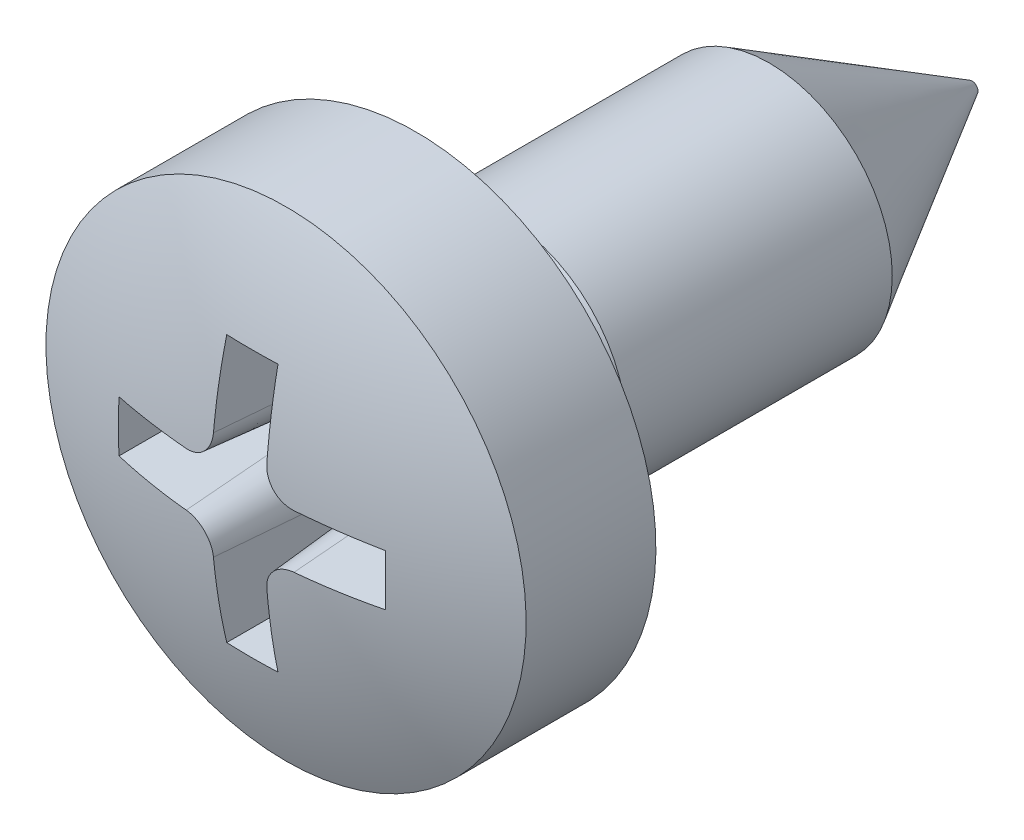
ISO-10303-21;
HEADER;
FILE_DESCRIPTION(('STEP AP214'),'2;1');
FILE_NAME('part.step','',(''),(''),'','','');
FILE_SCHEMA(('AUTOMOTIVE_DESIGN { 1 0 10303 214 1 1 1 1 }'));
ENDSEC;
DATA;
#1=APPLICATION_CONTEXT('core data for automotive mechanical design processes');
#2=APPLICATION_PROTOCOL_DEFINITION('international standard','automotive_design',2000,#1);
#3=PRODUCT_CONTEXT('',#1,'mechanical');
#4=PRODUCT('Part','Part','',(#3));
#5=PRODUCT_RELATED_PRODUCT_CATEGORY('part','',(#4));
#6=PRODUCT_DEFINITION_FORMATION('','',#4);
#7=PRODUCT_DEFINITION_CONTEXT('part definition',#1,'design');
#8=PRODUCT_DEFINITION('design','',#6,#7);
#9=PRODUCT_DEFINITION_SHAPE('','',#8);
#10=(LENGTH_UNIT() NAMED_UNIT(*) SI_UNIT(.MILLI.,.METRE.));
#11=(NAMED_UNIT(*) PLANE_ANGLE_UNIT() SI_UNIT($,.RADIAN.));
#12=(NAMED_UNIT(*) SI_UNIT($,.STERADIAN.) SOLID_ANGLE_UNIT());
#13=UNCERTAINTY_MEASURE_WITH_UNIT(LENGTH_MEASURE(1.E-05),#10,'distance_accuracy_value','');
#14=(GEOMETRIC_REPRESENTATION_CONTEXT(3) GLOBAL_UNCERTAINTY_ASSIGNED_CONTEXT((#13)) GLOBAL_UNIT_ASSIGNED_CONTEXT((#10,
#11,#12)) REPRESENTATION_CONTEXT('',''));
#15=CARTESIAN_POINT('',(0.,0.,0.));
#16=DIRECTION('',(0.,0.,1.));
#17=DIRECTION('',(1.,0.,0.));
#18=AXIS2_PLACEMENT_3D('',#15,#16,#17);
#19=CARTESIAN_POINT('',(0.,0.,-7.45));
#20=DIRECTION('',(0.,0.,1.));
#21=DIRECTION('',(0.,1.,0.));
#22=AXIS2_PLACEMENT_3D('',#19,#20,#21);
#23=SPHERICAL_SURFACE('',#22,10.5);
#24=CARTESIAN_POINT('',(0.,0.,2.21643677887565));
#25=DIRECTION('',(0.,0.,1.));
#26=DIRECTION('',(0.,-1.,0.));
#27=AXIS2_PLACEMENT_3D('',#24,#25,#26);
#28=CIRCLE('',#27,4.1);
#29=CARTESIAN_POINT('',(0.,-4.09999999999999,2.21643677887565));
#30=VERTEX_POINT('',#29);
#31=EDGE_CURVE('E244',#30,#30,#28,.T.);
#32=ORIENTED_EDGE('',*,*,#31,.T.);
#33=EDGE_LOOP('',(#32));
#34=FACE_BOUND('',#33,.T.);
#35=CARTESIAN_POINT('',(-0.455147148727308,0.,-7.4101797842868));
#36=DIRECTION('',(0.996194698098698,0.,-0.0871557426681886));
#37=DIRECTION('',(-0.0871557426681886,0.,-0.996194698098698));
#38=AXIS2_PLACEMENT_3D('',#35,#36,#37);
#39=CIRCLE('',#38,10.4900550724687);
#40=CARTESIAN_POINT('',(0.455598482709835,0.919999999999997,2.99969042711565));
#41=VERTEX_POINT('',#40);
#42=CARTESIAN_POINT('',(0.437316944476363,2.27731694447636,2.79073148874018));
#43=VERTEX_POINT('',#42);
#44=EDGE_CURVE('E11',#41,#43,#39,.F.);
#45=ORIENTED_EDGE('',*,*,#44,.F.);
#46=CARTESIAN_POINT('',(0.920200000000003,0.455596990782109,2.99967288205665));
#47=CARTESIAN_POINT('',(0.894011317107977,0.455764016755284,3.00197278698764));
#48=CARTESIAN_POINT('',(0.867825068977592,0.458173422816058,3.00407353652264));
#49=CARTESIAN_POINT('',(0.816202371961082,0.467324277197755,3.00782512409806));
#50=CARTESIAN_POINT('',(0.790765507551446,0.474063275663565,3.00947621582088));
#51=CARTESIAN_POINT('',(0.741339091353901,0.49172689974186,3.01228051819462));
#52=CARTESIAN_POINT('',(0.717350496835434,0.502654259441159,3.0134334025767));
#53=CARTESIAN_POINT('',(0.671535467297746,0.52838182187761,3.01520631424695));
#54=CARTESIAN_POINT('',(0.649708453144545,0.543180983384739,3.01582648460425));
#55=CARTESIAN_POINT('',(0.608935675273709,0.576158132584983,3.01651440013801));
#56=CARTESIAN_POINT('',(0.589976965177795,0.594320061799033,3.01658470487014));
#57=CARTESIAN_POINT('',(0.555356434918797,0.633555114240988,3.01617751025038));
#58=CARTESIAN_POINT('',(0.539695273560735,0.654628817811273,3.01569990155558));
#59=CARTESIAN_POINT('',(0.512139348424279,0.699042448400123,3.01421213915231));
#60=CARTESIAN_POINT('',(0.500238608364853,0.722378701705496,3.0132028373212));
#61=CARTESIAN_POINT('',(0.480501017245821,0.770678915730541,3.01068133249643));
#62=CARTESIAN_POINT('',(0.472661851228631,0.795641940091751,3.00916941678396));
#63=CARTESIAN_POINT('',(0.463297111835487,0.837339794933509,3.00631380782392));
#64=CARTESIAN_POINT('',(0.460515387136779,0.853812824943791,3.00510443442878));
#65=CARTESIAN_POINT('',(0.456726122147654,0.886921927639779,3.00251404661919));
#66=CARTESIAN_POINT('',(0.455715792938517,0.903557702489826,3.00113330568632));
#67=CARTESIAN_POINT('',(0.455596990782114,0.920199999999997,2.99967288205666));
#68=B_SPLINE_CURVE_WITH_KNOTS('',3,(#46,#47,#48,#49,#50,#51,#52,#53,#54,#55,#56,#57,#58,#59,#60,
#61,#62,#63,#64,#65,#66,#67),.UNSPECIFIED.,.F.,.F.,(4,2,2,2,2,2,2,2,2,2,4),(0.,
0.0787705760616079,0.157496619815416,0.236274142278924,0.315030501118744,0.393420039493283,
0.471825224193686,0.550105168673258,0.628340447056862,0.67850167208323,0.728583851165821),.UNSPECIFIED.);
#69=CARTESIAN_POINT('',(0.920000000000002,0.45559848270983,2.99969042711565));
#70=VERTEX_POINT('',#69);
#71=EDGE_CURVE('E38',#70,#41,#68,.T.);
#72=ORIENTED_EDGE('',*,*,#71,.F.);
#73=CARTESIAN_POINT('',(0.,-0.455147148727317,-7.4101797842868));
#74=DIRECTION('',(0.,0.996194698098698,-0.0871557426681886));
#75=DIRECTION('',(0.,0.0871557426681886,0.996194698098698));
#76=AXIS2_PLACEMENT_3D('',#73,#74,#75);
#77=CIRCLE('',#76,10.4900550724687);
#78=CARTESIAN_POINT('',(2.27731694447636,0.437316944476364,2.79073148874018));
#79=VERTEX_POINT('',#78);
#80=EDGE_CURVE('E349',#79,#70,#77,.F.);
#81=ORIENTED_EDGE('',*,*,#80,.F.);
#82=CARTESIAN_POINT('',(1.37087598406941,0.,-7.56993610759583));
#83=DIRECTION('',(0.996194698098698,0.,-0.0871557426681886));
#84=DIRECTION('',(-0.0871557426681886,0.,-0.996194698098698));
#85=AXIS2_PLACEMENT_3D('',#82,#83,#84);
#86=CIRCLE('',#85,10.4094339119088);
#87=CARTESIAN_POINT('',(2.27731694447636,-0.437316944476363,2.79073148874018));
#88=VERTEX_POINT('',#87);
#89=EDGE_CURVE('E350',#88,#79,#86,.F.);
#90=ORIENTED_EDGE('',*,*,#89,.F.);
#91=CARTESIAN_POINT('',(0.,0.455147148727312,-7.4101797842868));
#92=DIRECTION('',(0.,-0.996194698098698,-0.0871557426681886));
#93=DIRECTION('',(0.,0.0871557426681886,-0.996194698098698));
#94=AXIS2_PLACEMENT_3D('',#91,#92,#93);
#95=CIRCLE('',#94,10.4900550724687);
#96=CARTESIAN_POINT('',(0.920000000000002,-0.455598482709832,2.99969042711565));
#97=VERTEX_POINT('',#96);
#98=EDGE_CURVE('E319',#88,#97,#95,.T.);
#99=ORIENTED_EDGE('',*,*,#98,.T.);
#100=CARTESIAN_POINT('',(0.455596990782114,-0.9202,2.99967288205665));
#101=CARTESIAN_POINT('',(0.455764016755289,-0.894011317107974,3.00197278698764));
#102=CARTESIAN_POINT('',(0.458173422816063,-0.867825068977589,3.00407353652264));
#103=CARTESIAN_POINT('',(0.46732427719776,-0.816202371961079,3.00782512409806));
#104=CARTESIAN_POINT('',(0.47406327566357,-0.790765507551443,3.00947621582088));
#105=CARTESIAN_POINT('',(0.491726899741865,-0.741339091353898,3.01228051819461));
#106=CARTESIAN_POINT('',(0.502654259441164,-0.717350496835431,3.0134334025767));
#107=CARTESIAN_POINT('',(0.528381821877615,-0.671535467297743,3.01520631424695));
#108=CARTESIAN_POINT('',(0.543180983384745,-0.649708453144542,3.01582648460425));
#109=CARTESIAN_POINT('',(0.576158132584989,-0.608935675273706,3.01651440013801));
#110=CARTESIAN_POINT('',(0.594320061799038,-0.589976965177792,3.01658470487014));
#111=CARTESIAN_POINT('',(0.633555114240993,-0.555356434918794,3.01617751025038));
#112=CARTESIAN_POINT('',(0.654628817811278,-0.539695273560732,3.01569990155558));
#113=CARTESIAN_POINT('',(0.699042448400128,-0.512139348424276,3.01421213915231));
#114=CARTESIAN_POINT('',(0.722378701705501,-0.50023860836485,3.0132028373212));
#115=CARTESIAN_POINT('',(0.770678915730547,-0.480501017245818,3.01068133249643));
#116=CARTESIAN_POINT('',(0.795641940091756,-0.472661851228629,3.00916941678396));
#117=CARTESIAN_POINT('',(0.837339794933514,-0.463297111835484,3.00631380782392));
#118=CARTESIAN_POINT('',(0.853812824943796,-0.460515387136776,3.00510443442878));
#119=CARTESIAN_POINT('',(0.886921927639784,-0.456726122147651,3.00251404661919));
#120=CARTESIAN_POINT('',(0.903557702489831,-0.455715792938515,3.00113330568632));
#121=CARTESIAN_POINT('',(0.920200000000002,-0.455596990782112,2.99967288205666));
#122=B_SPLINE_CURVE_WITH_KNOTS('',3,(#100,#101,#102,#103,#104,#105,#106,#107,#108,#109,#110,
#111,#112,#113,#114,#115,#116,#117,#118,#119,#120,#121),.UNSPECIFIED.,.F.,.F.,(4,2,2,2,2,2,2,2,
2,2,4),(0.,0.0787705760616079,0.157496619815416,0.236274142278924,0.315030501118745,
0.393420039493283,0.471825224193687,0.550105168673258,0.628340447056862,0.67850167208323,
0.728583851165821),.UNSPECIFIED.);
#123=CARTESIAN_POINT('',(0.455598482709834,-0.919999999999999,2.99969042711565));
#124=VERTEX_POINT('',#123);
#125=EDGE_CURVE('E313',#124,#97,#122,.T.);
#126=ORIENTED_EDGE('',*,*,#125,.F.);
#127=CARTESIAN_POINT('',(-0.455147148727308,0.,-7.4101797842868));
#128=DIRECTION('',(0.996194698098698,0.,-0.0871557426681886));
#129=DIRECTION('',(-0.0871557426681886,0.,-0.996194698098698));
#130=AXIS2_PLACEMENT_3D('',#127,#128,#129);
#131=CIRCLE('',#130,10.4900550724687);
#132=CARTESIAN_POINT('',(0.437316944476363,-2.27731694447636,2.79073148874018));
#133=VERTEX_POINT('',#132);
#134=EDGE_CURVE('E310',#124,#133,#131,.T.);
#135=ORIENTED_EDGE('',*,*,#134,.T.);
#136=CARTESIAN_POINT('',(0.,-1.37087598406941,-7.56993610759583));
#137=DIRECTION('',(0.,-0.996194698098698,-0.0871557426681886));
#138=DIRECTION('',(0.,0.0871557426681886,-0.996194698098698));
#139=AXIS2_PLACEMENT_3D('',#136,#137,#138);
#140=CIRCLE('',#139,10.4094339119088);
#141=CARTESIAN_POINT('',(-0.437316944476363,-2.27731694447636,2.79073148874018));
#142=VERTEX_POINT('',#141);
#143=EDGE_CURVE('E307',#133,#142,#140,.T.);
#144=ORIENTED_EDGE('',*,*,#143,.T.);
#145=CARTESIAN_POINT('',(0.455147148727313,0.,-7.4101797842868));
#146=DIRECTION('',(-0.996194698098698,0.,-0.0871557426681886));
#147=DIRECTION('',(-0.0871557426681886,0.,0.996194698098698));
#148=AXIS2_PLACEMENT_3D('',#145,#146,#147);
#149=CIRCLE('',#148,10.4900550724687);
#150=CARTESIAN_POINT('',(-0.455598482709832,-0.92,2.99969042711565));
#151=VERTEX_POINT('',#150);
#152=EDGE_CURVE('E304',#151,#142,#149,.F.);
#153=ORIENTED_EDGE('',*,*,#152,.F.);
#154=CARTESIAN_POINT('',(-0.9202,-0.455596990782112,2.99967288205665));
#155=CARTESIAN_POINT('',(-0.894011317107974,-0.455764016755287,3.00197278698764));
#156=CARTESIAN_POINT('',(-0.867825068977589,-0.45817342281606,3.00407353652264));
#157=CARTESIAN_POINT('',(-0.816202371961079,-0.467324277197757,3.00782512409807));
#158=CARTESIAN_POINT('',(-0.790765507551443,-0.474063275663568,3.00947621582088));
#159=CARTESIAN_POINT('',(-0.741339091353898,-0.491726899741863,3.01228051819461));
#160=CARTESIAN_POINT('',(-0.717350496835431,-0.502654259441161,3.0134334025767));
#161=CARTESIAN_POINT('',(-0.671535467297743,-0.528381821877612,3.01520631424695));
#162=CARTESIAN_POINT('',(-0.649708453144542,-0.543180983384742,3.01582648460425));
#163=CARTESIAN_POINT('',(-0.608935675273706,-0.576158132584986,3.01651440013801));
#164=CARTESIAN_POINT('',(-0.589976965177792,-0.594320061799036,3.01658470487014));
#165=CARTESIAN_POINT('',(-0.555356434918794,-0.633555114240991,3.01617751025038));
#166=CARTESIAN_POINT('',(-0.539695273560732,-0.654628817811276,3.01569990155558));
#167=CARTESIAN_POINT('',(-0.512139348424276,-0.699042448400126,3.01421213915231));
#168=CARTESIAN_POINT('',(-0.50023860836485,-0.722378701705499,3.0132028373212));
#169=CARTESIAN_POINT('',(-0.480501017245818,-0.770678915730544,3.01068133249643));
#170=CARTESIAN_POINT('',(-0.472661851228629,-0.795641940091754,3.00916941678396));
#171=CARTESIAN_POINT('',(-0.463297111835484,-0.837339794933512,3.00631380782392));
#172=CARTESIAN_POINT('',(-0.460515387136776,-0.853812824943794,3.00510443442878));
#173=CARTESIAN_POINT('',(-0.456726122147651,-0.886921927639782,3.00251404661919));
#174=CARTESIAN_POINT('',(-0.455715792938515,-0.903557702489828,3.00113330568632));
#175=CARTESIAN_POINT('',(-0.455596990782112,-0.9202,2.99967288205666));
#176=B_SPLINE_CURVE_WITH_KNOTS('',3,(#154,#155,#156,#157,#158,#159,#160,#161,#162,#163,#164,
#165,#166,#167,#168,#169,#170,#171,#172,#173,#174,#175),.UNSPECIFIED.,.F.,.F.,(4,2,2,2,2,2,2,2,
2,2,4),(0.,0.0787705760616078,0.157496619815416,0.236274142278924,0.315030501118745,
0.393420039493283,0.471825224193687,0.550105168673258,0.628340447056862,0.67850167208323,
0.728583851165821),.UNSPECIFIED.);
#177=CARTESIAN_POINT('',(-0.92,-0.455598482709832,2.99969042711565));
#178=VERTEX_POINT('',#177);
#179=EDGE_CURVE('E298',#178,#151,#176,.T.);
#180=ORIENTED_EDGE('',*,*,#179,.F.);
#181=CARTESIAN_POINT('',(0.,0.455147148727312,-7.4101797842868));
#182=DIRECTION('',(0.,-0.996194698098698,-0.0871557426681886));
#183=DIRECTION('',(0.,0.0871557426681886,-0.996194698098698));
#184=AXIS2_PLACEMENT_3D('',#181,#182,#183);
#185=CIRCLE('',#184,10.4900550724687);
#186=CARTESIAN_POINT('',(-2.27731694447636,-0.437316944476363,2.79073148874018));
#187=VERTEX_POINT('',#186);
#188=EDGE_CURVE('E305',#187,#178,#185,.F.);
#189=ORIENTED_EDGE('',*,*,#188,.F.);
#190=CARTESIAN_POINT('',(-1.37087598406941,0.,-7.56993610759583));
#191=DIRECTION('',(-0.996194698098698,0.,-0.0871557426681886));
#192=DIRECTION('',(-0.0871557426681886,0.,0.996194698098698));
#193=AXIS2_PLACEMENT_3D('',#190,#191,#192);
#194=CIRCLE('',#193,10.4094339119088);
#195=CARTESIAN_POINT('',(-2.27731694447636,0.437316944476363,2.79073148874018));
#196=VERTEX_POINT('',#195);
#197=EDGE_CURVE('E377',#187,#196,#194,.T.);
#198=ORIENTED_EDGE('',*,*,#197,.T.);
#199=CARTESIAN_POINT('',(0.,-0.455147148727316,-7.4101797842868));
#200=DIRECTION('',(0.,0.996194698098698,-0.0871557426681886));
#201=DIRECTION('',(0.,0.0871557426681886,0.996194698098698));
#202=AXIS2_PLACEMENT_3D('',#199,#200,#201);
#203=CIRCLE('',#202,10.4900550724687);
#204=CARTESIAN_POINT('',(-0.92,0.455598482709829,2.99969042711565));
#205=VERTEX_POINT('',#204);
#206=EDGE_CURVE('E265',#196,#205,#203,.T.);
#207=ORIENTED_EDGE('',*,*,#206,.T.);
#208=CARTESIAN_POINT('',(-0.455596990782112,0.920199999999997,2.99967288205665));
#209=CARTESIAN_POINT('',(-0.455764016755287,0.894011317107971,3.00197278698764));
#210=CARTESIAN_POINT('',(-0.45817342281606,0.867825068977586,3.00407353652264));
#211=CARTESIAN_POINT('',(-0.467324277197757,0.816202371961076,3.00782512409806));
#212=CARTESIAN_POINT('',(-0.474063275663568,0.79076550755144,3.00947621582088));
#213=CARTESIAN_POINT('',(-0.491726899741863,0.741339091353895,3.01228051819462));
#214=CARTESIAN_POINT('',(-0.502654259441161,0.717350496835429,3.0134334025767));
#215=CARTESIAN_POINT('',(-0.528381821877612,0.67153546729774,3.01520631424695));
#216=CARTESIAN_POINT('',(-0.543180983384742,0.649708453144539,3.01582648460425));
#217=CARTESIAN_POINT('',(-0.576158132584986,0.608935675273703,3.01651440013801));
#218=CARTESIAN_POINT('',(-0.594320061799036,0.589976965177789,3.01658470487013));
#219=CARTESIAN_POINT('',(-0.633555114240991,0.555356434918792,3.01617751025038));
#220=CARTESIAN_POINT('',(-0.654628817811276,0.539695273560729,3.01569990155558));
#221=CARTESIAN_POINT('',(-0.699042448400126,0.512139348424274,3.01421213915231));
#222=CARTESIAN_POINT('',(-0.722378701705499,0.500238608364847,3.0132028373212));
#223=CARTESIAN_POINT('',(-0.770678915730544,0.480501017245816,3.01068133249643));
#224=CARTESIAN_POINT('',(-0.795641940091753,0.472661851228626,3.00916941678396));
#225=CARTESIAN_POINT('',(-0.837339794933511,0.463297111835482,3.00631380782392));
#226=CARTESIAN_POINT('',(-0.853812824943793,0.460515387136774,3.00510443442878));
#227=CARTESIAN_POINT('',(-0.886921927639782,0.456726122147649,3.00251404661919));
#228=CARTESIAN_POINT('',(-0.903557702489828,0.455715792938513,3.00113330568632));
#229=CARTESIAN_POINT('',(-0.9202,0.455596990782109,2.99967288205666));
#230=B_SPLINE_CURVE_WITH_KNOTS('',3,(#208,#209,#210,#211,#212,#213,#214,#215,#216,#217,#218,
#219,#220,#221,#222,#223,#224,#225,#226,#227,#228,#229),.UNSPECIFIED.,.F.,.F.,(4,2,2,2,2,2,2,2,
2,2,4),(0.,0.0787705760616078,0.157496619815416,0.236274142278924,0.315030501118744,
0.393420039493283,0.471825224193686,0.550105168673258,0.628340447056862,0.67850167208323,
0.728583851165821),.UNSPECIFIED.);
#231=CARTESIAN_POINT('',(-0.455598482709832,0.919999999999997,2.99969042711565));
#232=VERTEX_POINT('',#231);
#233=EDGE_CURVE('E258',#232,#205,#230,.T.);
#234=ORIENTED_EDGE('',*,*,#233,.F.);
#235=CARTESIAN_POINT('',(0.455147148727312,0.,-7.4101797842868));
#236=DIRECTION('',(-0.996194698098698,0.,-0.0871557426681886));
#237=DIRECTION('',(-0.0871557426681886,0.,0.996194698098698));
#238=AXIS2_PLACEMENT_3D('',#235,#236,#237);
#239=CIRCLE('',#238,10.4900550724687);
#240=CARTESIAN_POINT('',(-0.437316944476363,2.27731694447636,2.79073148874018));
#241=VERTEX_POINT('',#240);
#242=EDGE_CURVE('E255',#232,#241,#239,.T.);
#243=ORIENTED_EDGE('',*,*,#242,.T.);
#244=CARTESIAN_POINT('',(0.,1.37087598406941,-7.56993610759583));
#245=DIRECTION('',(0.,0.996194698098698,-0.0871557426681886));
#246=DIRECTION('',(0.,0.0871557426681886,0.996194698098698));
#247=AXIS2_PLACEMENT_3D('',#244,#245,#246);
#248=CIRCLE('',#247,10.4094339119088);
#249=EDGE_CURVE('E253',#43,#241,#248,.F.);
#250=ORIENTED_EDGE('',*,*,#249,.F.);
#251=EDGE_LOOP('',(#45,#72,#81,#90,#99,#126,#135,#144,#153,#180,#189,#198,#207,#234,#243,#250));
#252=FACE_BOUND('',#251,.T.);
#253=ADVANCED_FACE('F30',(#34,#252),#23,.T.);
#254=CARTESIAN_POINT('',(0.,0.,0.));
#255=DIRECTION('',(0.,0.,-1.));
#256=DIRECTION('',(0.,1.,0.));
#257=AXIS2_PLACEMENT_3D('',#254,#255,#256);
#258=CONICAL_SURFACE('',#257,1.5705,0.339344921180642);
#259=CARTESIAN_POINT('',(0.,0.,-1.5));
#260=DIRECTION('',(0.,0.,1.));
#261=DIRECTION('',(0.,-1.,0.));
#262=AXIS2_PLACEMENT_3D('',#259,#260,#261);
#263=CIRCLE('',#262,2.1);
#264=CARTESIAN_POINT('',(0.,-2.09999999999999,-1.5));
#265=VERTEX_POINT('',#264);
#266=EDGE_CURVE('E158',#265,#265,#263,.T.);
#267=ORIENTED_EDGE('',*,*,#266,.T.);
#268=EDGE_LOOP('',(#267));
#269=FACE_BOUND('',#268,.T.);
#270=CARTESIAN_POINT('',(0.,0.,0.));
#271=DIRECTION('',(0.,0.,1.));
#272=DIRECTION('',(0.,-1.,0.));
#273=AXIS2_PLACEMENT_3D('',#270,#271,#272);
#274=CIRCLE('',#273,1.5705);
#275=CARTESIAN_POINT('',(0.,-1.57049999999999,0.));
#276=VERTEX_POINT('',#275);
#277=EDGE_CURVE('E250',#276,#276,#274,.T.);
#278=ORIENTED_EDGE('',*,*,#277,.F.);
#279=EDGE_LOOP('',(#278));
#280=FACE_BOUND('',#279,.T.);
#281=ADVANCED_FACE('F32',(#269,#280),#258,.T.);
#282=CARTESIAN_POINT('',(0.,4.1,0.));
#283=DIRECTION('',(0.,0.,-1.));
#284=DIRECTION('',(0.,1.,0.));
#285=AXIS2_PLACEMENT_3D('',#282,#283,#284);
#286=PLANE('',#285);
#287=ORIENTED_EDGE('',*,*,#277,.T.);
#288=EDGE_LOOP('',(#287));
#289=FACE_BOUND('',#288,.T.);
#290=CARTESIAN_POINT('',(0.,0.,0.));
#291=DIRECTION('',(0.,0.,1.));
#292=DIRECTION('',(0.,-1.,0.));
#293=AXIS2_PLACEMENT_3D('',#290,#291,#292);
#294=CIRCLE('',#293,4.1);
#295=CARTESIAN_POINT('',(0.,-4.09999999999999,0.));
#296=VERTEX_POINT('',#295);
#297=EDGE_CURVE('E247',#296,#296,#294,.T.);
#298=ORIENTED_EDGE('',*,*,#297,.F.);
#299=EDGE_LOOP('',(#298));
#300=FACE_BOUND('',#299,.T.);
#301=ADVANCED_FACE('F400',(#289,#300),#286,.T.);
#302=CARTESIAN_POINT('',(0.,0.,23.7610145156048));
#303=DIRECTION('',(0.,0.,1.));
#304=DIRECTION('',(0.,-1.,0.));
#305=AXIS2_PLACEMENT_3D('',#302,#303,#304);
#306=CYLINDRICAL_SURFACE('',#305,4.1);
#307=ORIENTED_EDGE('',*,*,#297,.T.);
#308=EDGE_LOOP('',(#307));
#309=FACE_BOUND('',#308,.T.);
#310=ORIENTED_EDGE('',*,*,#31,.F.);
#311=EDGE_LOOP('',(#310));
#312=FACE_BOUND('',#311,.T.);
#313=ADVANCED_FACE('F404',(#309,#312),#306,.T.);
#314=CARTESIAN_POINT('',(0.,0.1,-9.5));
#315=DIRECTION('',(0.,0.,-1.));
#316=DIRECTION('',(0.,1.,0.));
#317=AXIS2_PLACEMENT_3D('',#314,#315,#316);
#318=PLANE('',#317);
#319=CARTESIAN_POINT('',(0.,0.,-9.5));
#320=DIRECTION('',(0.,0.,1.));
#321=DIRECTION('',(0.,-1.,0.));
#322=AXIS2_PLACEMENT_3D('',#319,#320,#321);
#323=CIRCLE('',#322,0.0999999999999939);
#324=CARTESIAN_POINT('',(0.,-0.0999999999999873,-9.5));
#325=VERTEX_POINT('',#324);
#326=EDGE_CURVE('E241',#325,#325,#323,.T.);
#327=ORIENTED_EDGE('',*,*,#326,.F.);
#328=EDGE_LOOP('',(#327));
#329=FACE_BOUND('',#328,.T.);
#330=ADVANCED_FACE('F406',(#329),#318,.T.);
#331=CARTESIAN_POINT('',(0.,0.,-9.5));
#332=DIRECTION('',(0.,0.,1.));
#333=DIRECTION('',(0.,-1.,0.));
#334=AXIS2_PLACEMENT_3D('',#331,#332,#333);
#335=CONICAL_SURFACE('',#334,0.0999999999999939,0.523598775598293);
#336=CARTESIAN_POINT('',(0.,0.,-6.0358983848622));
#337=DIRECTION('',(0.,0.,1.));
#338=DIRECTION('',(0.,-1.,0.));
#339=AXIS2_PLACEMENT_3D('',#336,#337,#338);
#340=CIRCLE('',#339,2.09999999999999);
#341=CARTESIAN_POINT('',(0.,-2.09999999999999,-6.0358983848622));
#342=VERTEX_POINT('',#341);
#343=EDGE_CURVE('E162',#342,#342,#340,.T.);
#344=CARTESIAN_POINT('',(0.,-2.09999999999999,-6.0358983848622));
#345=CARTESIAN_POINT('',(0.,-2.07916666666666,-6.07198277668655));
#346=CARTESIAN_POINT('',(0.,-2.05833333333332,-6.1080671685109));
#347=CARTESIAN_POINT('',(0.,-2.01666666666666,-6.18023595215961));
#348=CARTESIAN_POINT('',(0.,-1.99583333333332,-6.21632034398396));
#349=CARTESIAN_POINT('',(0.,-1.95416666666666,-6.28848912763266));
#350=CARTESIAN_POINT('',(0.,-1.93333333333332,-6.32457351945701));
#351=CARTESIAN_POINT('',(0.,-1.89166666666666,-6.39674230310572));
#352=CARTESIAN_POINT('',(0.,-1.87083333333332,-6.43282669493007));
#353=CARTESIAN_POINT('',(0.,-1.82916666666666,-6.50499547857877));
#354=CARTESIAN_POINT('',(0.,-1.80833333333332,-6.54107987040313));
#355=CARTESIAN_POINT('',(0.,-1.76666666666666,-6.61324865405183));
#356=CARTESIAN_POINT('',(0.,-1.74583333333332,-6.64933304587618));
#357=CARTESIAN_POINT('',(0.,-1.70416666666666,-6.72150182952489));
#358=CARTESIAN_POINT('',(0.,-1.68333333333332,-6.75758622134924));
#359=CARTESIAN_POINT('',(0.,-1.64166666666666,-6.82975500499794));
#360=CARTESIAN_POINT('',(0.,-1.62083333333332,-6.8658393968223));
#361=CARTESIAN_POINT('',(0.,-1.57916666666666,-6.938008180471));
#362=CARTESIAN_POINT('',(0.,-1.55833333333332,-6.97409257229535));
#363=CARTESIAN_POINT('',(0.,-1.51666666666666,-7.04626135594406));
#364=CARTESIAN_POINT('',(0.,-1.49583333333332,-7.08234574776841));
#365=CARTESIAN_POINT('',(0.,-1.45416666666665,-7.15451453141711));
#366=CARTESIAN_POINT('',(0.,-1.43333333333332,-7.19059892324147));
#367=CARTESIAN_POINT('',(0.,-1.39166666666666,-7.26276770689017));
#368=CARTESIAN_POINT('',(0.,-1.37083333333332,-7.29885209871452));
#369=CARTESIAN_POINT('',(0.,-1.32916666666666,-7.37102088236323));
#370=CARTESIAN_POINT('',(0.,-1.30833333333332,-7.40710527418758));
#371=CARTESIAN_POINT('',(0.,-1.26666666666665,-7.47927405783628));
#372=CARTESIAN_POINT('',(0.,-1.24583333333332,-7.51535844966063));
#373=CARTESIAN_POINT('',(0.,-1.20416666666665,-7.58752723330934));
#374=CARTESIAN_POINT('',(0.,-1.18333333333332,-7.62361162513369));
#375=CARTESIAN_POINT('',(0.,-1.14166666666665,-7.6957804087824));
#376=CARTESIAN_POINT('',(0.,-1.12083333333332,-7.73186480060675));
#377=CARTESIAN_POINT('',(0.,-1.07916666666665,-7.80403358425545));
#378=CARTESIAN_POINT('',(0.,-1.05833333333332,-7.8401179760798));
#379=CARTESIAN_POINT('',(0.,-1.01666666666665,-7.91228675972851));
#380=CARTESIAN_POINT('',(0.,-0.995833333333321,-7.94837115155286));
#381=CARTESIAN_POINT('',(0.,-0.954166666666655,-8.02053993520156));
#382=CARTESIAN_POINT('',(0.,-0.933333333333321,-8.05662432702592));
#383=CARTESIAN_POINT('',(0.,-0.891666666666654,-8.12879311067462));
#384=CARTESIAN_POINT('',(0.,-0.870833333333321,-8.16487750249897));
#385=CARTESIAN_POINT('',(0.,-0.829166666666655,-8.23704628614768));
#386=CARTESIAN_POINT('',(0.,-0.808333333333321,-8.27313067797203));
#387=CARTESIAN_POINT('',(0.,-0.766666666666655,-8.34529946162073));
#388=CARTESIAN_POINT('',(0.,-0.745833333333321,-8.38138385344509));
#389=CARTESIAN_POINT('',(0.,-0.704166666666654,-8.45355263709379));
#390=CARTESIAN_POINT('',(0.,-0.683333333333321,-8.48963702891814));
#391=CARTESIAN_POINT('',(0.,-0.641666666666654,-8.56180581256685));
#392=CARTESIAN_POINT('',(0.,-0.620833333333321,-8.5978902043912));
#393=CARTESIAN_POINT('',(0.,-0.579166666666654,-8.6700589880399));
#394=CARTESIAN_POINT('',(0.,-0.558333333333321,-8.70614337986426));
#395=CARTESIAN_POINT('',(0.,-0.516666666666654,-8.77831216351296));
#396=CARTESIAN_POINT('',(0.,-0.495833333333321,-8.81439655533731));
#397=CARTESIAN_POINT('',(0.,-0.454166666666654,-8.88656533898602));
#398=CARTESIAN_POINT('',(0.,-0.433333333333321,-8.92264973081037));
#399=CARTESIAN_POINT('',(0.,-0.391666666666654,-8.99481851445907));
#400=CARTESIAN_POINT('',(0.,-0.370833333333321,-9.03090290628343));
#401=CARTESIAN_POINT('',(0.,-0.329166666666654,-9.10307168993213));
#402=CARTESIAN_POINT('',(0.,-0.308333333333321,-9.13915608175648));
#403=CARTESIAN_POINT('',(0.,-0.266666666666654,-9.21132486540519));
#404=CARTESIAN_POINT('',(0.,-0.245833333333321,-9.24740925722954));
#405=CARTESIAN_POINT('',(0.,-0.204166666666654,-9.31957804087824));
#406=CARTESIAN_POINT('',(0.,-0.183333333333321,-9.35566243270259));
#407=CARTESIAN_POINT('',(0.,-0.141666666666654,-9.4278312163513));
#408=CARTESIAN_POINT('',(0.,-0.120833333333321,-9.46391560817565));
#409=CARTESIAN_POINT('',(0.,-0.0999999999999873,-9.5));
#410=B_SPLINE_CURVE_WITH_KNOTS('',3,(#344,#345,#346,#347,#348,#349,#350,#351,#352,#353,#354,
#355,#356,#357,#358,#359,#360,#361,#362,#363,#364,#365,#366,#367,#368,#369,#370,#371,#372,#373,
#374,#375,#376,#377,#378,#379,#380,#381,#382,#383,#384,#385,#386,#387,#388,#389,#390,#391,#392,
#393,#394,#395,#396,#397,#398,#399,#400,#401,#402,#403,#404,#405,#406,#407,#408,#409),
.UNSPECIFIED.,.F.,.F.,(4,2,2,2,2,2,2,2,2,2,2,2,2,2,2,2,2,2,2,2,2,2,2,2,2,2,2,2,2,2,2,2,4),(0.,
0.125000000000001,0.250000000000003,0.375000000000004,0.500000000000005,0.625000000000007,
0.750000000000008,0.87500000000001,1.00000000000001,1.12500000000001,1.25000000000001,
1.37500000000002,1.50000000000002,1.62500000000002,1.75000000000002,1.87500000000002,
2.00000000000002,2.12500000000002,2.25000000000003,2.37500000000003,2.50000000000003,
2.62500000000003,2.75000000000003,2.87500000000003,3.00000000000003,3.12500000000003,
3.25000000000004,3.37500000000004,3.50000000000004,3.62500000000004,3.75000000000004,
3.87500000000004,4.00000000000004),.UNSPECIFIED.);
#411=EDGE_CURVE('BSEAM412',#342,#325,#410,.T.);
#412=ORIENTED_EDGE('',*,*,#343,.F.);
#413=ORIENTED_EDGE('',*,*,#326,.T.);
#414=ORIENTED_EDGE('',*,*,#411,.T.);
#415=ORIENTED_EDGE('',*,*,#411,.F.);
#416=EDGE_LOOP('',(#412,#414,#413,#415));
#417=FACE_BOUND('',#416,.T.);
#418=ADVANCED_FACE('F412',(#417),#335,.T.);
#419=CARTESIAN_POINT('',(0.,0.,23.7610145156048));
#420=DIRECTION('',(0.,0.,1.));
#421=DIRECTION('',(0.,-1.,0.));
#422=AXIS2_PLACEMENT_3D('',#419,#420,#421);
#423=CYLINDRICAL_SURFACE('',#422,2.1);
#424=ORIENTED_EDGE('',*,*,#343,.T.);
#425=EDGE_LOOP('',(#424));
#426=FACE_BOUND('',#425,.T.);
#427=ORIENTED_EDGE('',*,*,#266,.F.);
#428=EDGE_LOOP('',(#427));
#429=FACE_BOUND('',#428,.T.);
#430=ADVANCED_FACE('F343',(#426,#429),#423,.T.);
#431=CARTESIAN_POINT('',(0.46,2.3,3.05));
#432=DIRECTION('',(0.996194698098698,0.,-0.0871557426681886));
#433=DIRECTION('',(-0.0871557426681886,0.,-0.996194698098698));
#434=AXIS2_PLACEMENT_3D('',#431,#432,#433);
#435=PLANE('',#434);
#436=ORIENTED_EDGE('',*,*,#44,.T.);
#437=DIRECTION('',(0.0868265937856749,0.086826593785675,0.992432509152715));
#438=VECTOR('',#437,1.);
#439=CARTESIAN_POINT('',(0.46,2.3,3.05));
#440=LINE('',#439,#438);
#441=CARTESIAN_POINT('',(0.223780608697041,2.06378060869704,0.349999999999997));
#442=VERTEX_POINT('',#441);
#443=EDGE_CURVE('E45',#442,#43,#440,.T.);
#444=ORIENTED_EDGE('',*,*,#443,.F.);
#445=DIRECTION('',(0.,1.,0.));
#446=VECTOR('',#445,1.);
#447=CARTESIAN_POINT('',(0.223780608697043,0.919999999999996,0.349999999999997));
#448=LINE('',#447,#446);
#449=CARTESIAN_POINT('',(0.223780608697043,0.919999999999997,0.349999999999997));
#450=VERTEX_POINT('',#449);
#451=EDGE_CURVE('E147',#442,#450,#448,.F.);
#452=ORIENTED_EDGE('',*,*,#451,.T.);
#453=DIRECTION('',(0.0871557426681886,0.,0.996194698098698));
#454=VECTOR('',#453,1.);
#455=CARTESIAN_POINT('',(0.460000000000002,0.919999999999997,3.05));
#456=LINE('',#455,#454);
#457=EDGE_CURVE('E154',#450,#41,#456,.T.);
#458=ORIENTED_EDGE('',*,*,#457,.T.);
#459=EDGE_LOOP('',(#436,#444,#452,#458));
#460=FACE_BOUND('',#459,.T.);
#461=ADVANCED_FACE('F153',(#460),#435,.F.);
#462=CARTESIAN_POINT('',(0.920000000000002,0.919999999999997,3.05));
#463=DIRECTION('',(0.,0.,-1.));
#464=DIRECTION('',(1.,0.,0.));
#465=AXIS2_PLACEMENT_3D('',#462,#463,#464);
#466=CONICAL_SURFACE('',#465,0.46,0.0872664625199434);
#467=ORIENTED_EDGE('',*,*,#71,.T.);
#468=ORIENTED_EDGE('',*,*,#457,.F.);
#469=CARTESIAN_POINT('',(0.920000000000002,0.919999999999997,0.349999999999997));
#470=DIRECTION('',(0.,0.,1.));
#471=DIRECTION('',(1.,0.,0.));
#472=AXIS2_PLACEMENT_3D('',#469,#470,#471);
#473=CIRCLE('',#472,0.696219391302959);
#474=CARTESIAN_POINT('',(0.920000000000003,0.223780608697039,0.349999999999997));
#475=VERTEX_POINT('',#474);
#476=EDGE_CURVE('E143',#450,#475,#473,.T.);
#477=ORIENTED_EDGE('',*,*,#476,.T.);
#478=DIRECTION('',(0.,0.0871557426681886,0.996194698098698));
#479=VECTOR('',#478,1.);
#480=CARTESIAN_POINT('',(0.920000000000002,0.459999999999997,3.05));
#481=LINE('',#480,#479);
#482=EDGE_CURVE('E159',#475,#70,#481,.T.);
#483=ORIENTED_EDGE('',*,*,#482,.T.);
#484=EDGE_LOOP('',(#467,#468,#477,#483));
#485=FACE_BOUND('',#484,.T.);
#486=ADVANCED_FACE('F157',(#485),#466,.T.);
#487=CARTESIAN_POINT('',(0.920000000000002,0.459999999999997,3.05));
#488=DIRECTION('',(0.,0.996194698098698,-0.0871557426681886));
#489=DIRECTION('',(0.,0.0871557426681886,0.996194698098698));
#490=AXIS2_PLACEMENT_3D('',#487,#488,#489);
#491=PLANE('',#490);
#492=ORIENTED_EDGE('',*,*,#80,.T.);
#493=ORIENTED_EDGE('',*,*,#482,.F.);
#494=DIRECTION('',(-1.,0.,0.));
#495=VECTOR('',#494,1.);
#496=CARTESIAN_POINT('',(0.920000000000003,0.223780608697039,0.349999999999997));
#497=LINE('',#496,#495);
#498=CARTESIAN_POINT('',(2.06378060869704,0.223780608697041,0.349999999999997));
#499=VERTEX_POINT('',#498);
#500=EDGE_CURVE('E149',#475,#499,#497,.F.);
#501=ORIENTED_EDGE('',*,*,#500,.T.);
#502=DIRECTION('',(0.086826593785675,0.0868265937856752,0.992432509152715));
#503=VECTOR('',#502,1.);
#504=CARTESIAN_POINT('',(2.3,0.46,3.05));
#505=LINE('',#504,#503);
#506=EDGE_CURVE('E164',#499,#79,#505,.T.);
#507=ORIENTED_EDGE('',*,*,#506,.T.);
#508=EDGE_LOOP('',(#492,#493,#501,#507));
#509=FACE_BOUND('',#508,.T.);
#510=ADVANCED_FACE('F335',(#509),#491,.F.);
#511=CARTESIAN_POINT('',(2.3,0.46,3.05));
#512=DIRECTION('',(0.996194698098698,0.,-0.0871557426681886));
#513=DIRECTION('',(-0.0871557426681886,0.,-0.996194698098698));
#514=AXIS2_PLACEMENT_3D('',#511,#512,#513);
#515=PLANE('',#514);
#516=ORIENTED_EDGE('',*,*,#89,.T.);
#517=ORIENTED_EDGE('',*,*,#506,.F.);
#518=DIRECTION('',(0.,1.,0.));
#519=VECTOR('',#518,1.);
#520=CARTESIAN_POINT('',(2.06378060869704,0.919999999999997,0.349999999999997));
#521=LINE('',#520,#519);
#522=CARTESIAN_POINT('',(2.06378060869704,-0.223780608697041,0.349999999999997));
#523=VERTEX_POINT('',#522);
#524=EDGE_CURVE('E208',#499,#523,#521,.F.);
#525=ORIENTED_EDGE('',*,*,#524,.T.);
#526=DIRECTION('',(-0.086826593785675,0.086826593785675,-0.992432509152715));
#527=VECTOR('',#526,1.);
#528=CARTESIAN_POINT('',(2.29306425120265,-0.453064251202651,2.97072402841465));
#529=LINE('',#528,#527);
#530=EDGE_CURVE('E202',#523,#88,#529,.F.);
#531=ORIENTED_EDGE('',*,*,#530,.T.);
#532=EDGE_LOOP('',(#516,#517,#525,#531));
#533=FACE_BOUND('',#532,.T.);
#534=ADVANCED_FACE('F331',(#533),#515,.F.);
#535=CARTESIAN_POINT('',(0.920000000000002,-0.46,3.05));
#536=DIRECTION('',(0.,-0.996194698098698,-0.0871557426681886));
#537=DIRECTION('',(0.,0.0871557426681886,-0.996194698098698));
#538=AXIS2_PLACEMENT_3D('',#535,#536,#537);
#539=PLANE('',#538);
#540=ORIENTED_EDGE('',*,*,#530,.F.);
#541=DIRECTION('',(1.,0.,0.));
#542=VECTOR('',#541,1.);
#543=CARTESIAN_POINT('',(0.920000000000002,-0.223780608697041,0.349999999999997));
#544=LINE('',#543,#542);
#545=CARTESIAN_POINT('',(0.920000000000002,-0.223780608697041,0.349999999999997));
#546=VERTEX_POINT('',#545);
#547=EDGE_CURVE('E210',#546,#523,#544,.T.);
#548=ORIENTED_EDGE('',*,*,#547,.F.);
#549=DIRECTION('',(0.,-0.0871557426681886,0.996194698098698));
#550=VECTOR('',#549,1.);
#551=CARTESIAN_POINT('',(0.920000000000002,-0.46,3.05));
#552=LINE('',#551,#550);
#553=EDGE_CURVE('E199',#546,#97,#552,.T.);
#554=ORIENTED_EDGE('',*,*,#553,.T.);
#555=ORIENTED_EDGE('',*,*,#98,.F.);
#556=EDGE_LOOP('',(#540,#548,#554,#555));
#557=FACE_BOUND('',#556,.T.);
#558=ADVANCED_FACE('F327',(#557),#539,.F.);
#559=CARTESIAN_POINT('',(0.920000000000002,-0.92,3.05));
#560=DIRECTION('',(0.,0.,-1.));
#561=DIRECTION('',(1.,0.,0.));
#562=AXIS2_PLACEMENT_3D('',#559,#560,#561);
#563=CONICAL_SURFACE('',#562,0.46,0.0872664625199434);
#564=ORIENTED_EDGE('',*,*,#125,.T.);
#565=ORIENTED_EDGE('',*,*,#553,.F.);
#566=CARTESIAN_POINT('',(0.920000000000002,-0.92,0.349999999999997));
#567=DIRECTION('',(0.,0.,1.));
#568=DIRECTION('',(1.,0.,0.));
#569=AXIS2_PLACEMENT_3D('',#566,#567,#568);
#570=CIRCLE('',#569,0.696219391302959);
#571=CARTESIAN_POINT('',(0.223780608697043,-0.919999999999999,0.349999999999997));
#572=VERTEX_POINT('',#571);
#573=EDGE_CURVE('E213',#546,#572,#570,.T.);
#574=ORIENTED_EDGE('',*,*,#573,.T.);
#575=DIRECTION('',(0.0871557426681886,0.,0.996194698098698));
#576=VECTOR('',#575,1.);
#577=CARTESIAN_POINT('',(0.460000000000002,-0.919999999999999,3.05));
#578=LINE('',#577,#576);
#579=EDGE_CURVE('E196',#572,#124,#578,.T.);
#580=ORIENTED_EDGE('',*,*,#579,.T.);
#581=EDGE_LOOP('',(#564,#565,#574,#580));
#582=FACE_BOUND('',#581,.T.);
#583=ADVANCED_FACE('F321',(#582),#563,.T.);
#584=CARTESIAN_POINT('',(0.46,-2.3,3.05));
#585=DIRECTION('',(0.996194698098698,0.,-0.0871557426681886));
#586=DIRECTION('',(-0.0871557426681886,0.,-0.996194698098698));
#587=AXIS2_PLACEMENT_3D('',#584,#585,#586);
#588=PLANE('',#587);
#589=ORIENTED_EDGE('',*,*,#579,.F.);
#590=DIRECTION('',(0.,1.,0.));
#591=VECTOR('',#590,1.);
#592=CARTESIAN_POINT('',(0.223780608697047,0.919999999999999,0.349999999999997));
#593=LINE('',#592,#591);
#594=CARTESIAN_POINT('',(0.223780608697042,-2.06378060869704,0.349999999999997));
#595=VERTEX_POINT('',#594);
#596=EDGE_CURVE('E215',#595,#572,#593,.T.);
#597=ORIENTED_EDGE('',*,*,#596,.F.);
#598=DIRECTION('',(0.0868265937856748,-0.086826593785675,0.992432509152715));
#599=VECTOR('',#598,1.);
#600=CARTESIAN_POINT('',(0.453064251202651,-2.29306425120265,2.97072402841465));
#601=LINE('',#600,#599);
#602=EDGE_CURVE('E193',#595,#133,#601,.T.);
#603=ORIENTED_EDGE('',*,*,#602,.T.);
#604=ORIENTED_EDGE('',*,*,#134,.F.);
#605=EDGE_LOOP('',(#589,#597,#603,#604));
#606=FACE_BOUND('',#605,.T.);
#607=ADVANCED_FACE('F326',(#606),#588,.F.);
#608=CARTESIAN_POINT('',(-0.46,-2.3,3.05));
#609=DIRECTION('',(0.,-0.996194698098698,-0.0871557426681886));
#610=DIRECTION('',(0.,0.0871557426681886,-0.996194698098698));
#611=AXIS2_PLACEMENT_3D('',#608,#609,#610);
#612=PLANE('',#611);
#613=ORIENTED_EDGE('',*,*,#602,.F.);
#614=DIRECTION('',(1.,0.,0.));
#615=VECTOR('',#614,1.);
#616=CARTESIAN_POINT('',(0.920000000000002,-2.06378060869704,0.349999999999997));
#617=LINE('',#616,#615);
#618=CARTESIAN_POINT('',(-0.223780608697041,-2.06378060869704,0.349999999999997));
#619=VERTEX_POINT('',#618);
#620=EDGE_CURVE('E218',#619,#595,#617,.T.);
#621=ORIENTED_EDGE('',*,*,#620,.F.);
#622=DIRECTION('',(0.086826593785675,0.086826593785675,-0.992432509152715));
#623=VECTOR('',#622,1.);
#624=CARTESIAN_POINT('',(-0.46,-2.3,3.05));
#625=LINE('',#624,#623);
#626=EDGE_CURVE('E190',#619,#142,#625,.F.);
#627=ORIENTED_EDGE('',*,*,#626,.T.);
#628=ORIENTED_EDGE('',*,*,#143,.F.);
#629=EDGE_LOOP('',(#613,#621,#627,#628));
#630=FACE_BOUND('',#629,.T.);
#631=ADVANCED_FACE('F366',(#630),#612,.F.);
#632=CARTESIAN_POINT('',(-0.46,-2.3,3.05));
#633=DIRECTION('',(-0.996194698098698,0.,-0.0871557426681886));
#634=DIRECTION('',(-0.0871557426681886,0.,0.996194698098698));
#635=AXIS2_PLACEMENT_3D('',#632,#633,#634);
#636=PLANE('',#635);
#637=ORIENTED_EDGE('',*,*,#152,.T.);
#638=ORIENTED_EDGE('',*,*,#626,.F.);
#639=DIRECTION('',(0.,-1.,0.));
#640=VECTOR('',#639,1.);
#641=CARTESIAN_POINT('',(-0.22378060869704,0.919999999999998,0.349999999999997));
#642=LINE('',#641,#640);
#643=CARTESIAN_POINT('',(-0.223780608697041,-0.92,0.349999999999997));
#644=VERTEX_POINT('',#643);
#645=EDGE_CURVE('E221',#619,#644,#642,.F.);
#646=ORIENTED_EDGE('',*,*,#645,.T.);
#647=DIRECTION('',(-0.0871557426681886,0.,0.996194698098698));
#648=VECTOR('',#647,1.);
#649=CARTESIAN_POINT('',(-0.46,-0.92,3.05));
#650=LINE('',#649,#648);
#651=EDGE_CURVE('E187',#644,#151,#650,.T.);
#652=ORIENTED_EDGE('',*,*,#651,.T.);
#653=EDGE_LOOP('',(#637,#638,#646,#652));
#654=FACE_BOUND('',#653,.T.);
#655=ADVANCED_FACE('F294',(#654),#636,.F.);
#656=CARTESIAN_POINT('',(-0.92,-0.92,3.05));
#657=DIRECTION('',(0.,0.,-1.));
#658=DIRECTION('',(1.,0.,0.));
#659=AXIS2_PLACEMENT_3D('',#656,#657,#658);
#660=CONICAL_SURFACE('',#659,0.46,0.0872664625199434);
#661=ORIENTED_EDGE('',*,*,#179,.T.);
#662=ORIENTED_EDGE('',*,*,#651,.F.);
#663=CARTESIAN_POINT('',(-0.92,-0.92,0.349999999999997));
#664=DIRECTION('',(0.,0.,1.));
#665=DIRECTION('',(1.,0.,0.));
#666=AXIS2_PLACEMENT_3D('',#663,#664,#665);
#667=CIRCLE('',#666,0.696219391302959);
#668=CARTESIAN_POINT('',(-0.92,-0.223780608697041,0.349999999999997));
#669=VERTEX_POINT('',#668);
#670=EDGE_CURVE('E223',#644,#669,#667,.T.);
#671=ORIENTED_EDGE('',*,*,#670,.T.);
#672=DIRECTION('',(0.,-0.0871557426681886,0.996194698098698));
#673=VECTOR('',#672,1.);
#674=CARTESIAN_POINT('',(-0.92,-0.46,3.05));
#675=LINE('',#674,#673);
#676=EDGE_CURVE('E184',#669,#178,#675,.T.);
#677=ORIENTED_EDGE('',*,*,#676,.T.);
#678=EDGE_LOOP('',(#661,#662,#671,#677));
#679=FACE_BOUND('',#678,.T.);
#680=ADVANCED_FACE('F289',(#679),#660,.T.);
#681=CARTESIAN_POINT('',(-0.92,-0.46,3.05));
#682=DIRECTION('',(0.,-0.996194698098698,-0.0871557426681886));
#683=DIRECTION('',(0.,0.0871557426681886,-0.996194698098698));
#684=AXIS2_PLACEMENT_3D('',#681,#682,#683);
#685=PLANE('',#684);
#686=ORIENTED_EDGE('',*,*,#188,.T.);
#687=ORIENTED_EDGE('',*,*,#676,.F.);
#688=DIRECTION('',(1.,0.,0.));
#689=VECTOR('',#688,1.);
#690=CARTESIAN_POINT('',(0.920000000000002,-0.223780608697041,0.349999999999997));
#691=LINE('',#690,#689);
#692=CARTESIAN_POINT('',(-2.06378060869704,-0.223780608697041,0.349999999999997));
#693=VERTEX_POINT('',#692);
#694=EDGE_CURVE('E225',#669,#693,#691,.F.);
#695=ORIENTED_EDGE('',*,*,#694,.T.);
#696=DIRECTION('',(0.0868265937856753,0.086826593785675,-0.992432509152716));
#697=VECTOR('',#696,1.);
#698=CARTESIAN_POINT('',(-2.28959637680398,-0.449596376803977,2.93108604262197));
#699=LINE('',#698,#697);
#700=EDGE_CURVE('E181',#693,#187,#699,.F.);
#701=ORIENTED_EDGE('',*,*,#700,.T.);
#702=EDGE_LOOP('',(#686,#687,#695,#701));
#703=FACE_BOUND('',#702,.T.);
#704=ADVANCED_FACE('F285',(#703),#685,.F.);
#705=CARTESIAN_POINT('',(-2.3,0.46,3.05));
#706=DIRECTION('',(-0.996194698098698,0.,-0.0871557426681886));
#707=DIRECTION('',(-0.0871557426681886,0.,0.996194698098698));
#708=AXIS2_PLACEMENT_3D('',#705,#706,#707);
#709=PLANE('',#708);
#710=ORIENTED_EDGE('',*,*,#700,.F.);
#711=DIRECTION('',(0.,-1.,0.));
#712=VECTOR('',#711,1.);
#713=CARTESIAN_POINT('',(-2.06378060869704,0.920000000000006,0.349999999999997));
#714=LINE('',#713,#712);
#715=CARTESIAN_POINT('',(-2.06378060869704,0.22378060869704,0.349999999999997));
#716=VERTEX_POINT('',#715);
#717=EDGE_CURVE('E227',#716,#693,#714,.T.);
#718=ORIENTED_EDGE('',*,*,#717,.F.);
#719=DIRECTION('',(-0.0868265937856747,0.0868265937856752,0.992432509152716));
#720=VECTOR('',#719,1.);
#721=CARTESIAN_POINT('',(-2.28959637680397,0.449596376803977,2.93108604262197));
#722=LINE('',#721,#720);
#723=EDGE_CURVE('E178',#716,#196,#722,.T.);
#724=ORIENTED_EDGE('',*,*,#723,.T.);
#725=ORIENTED_EDGE('',*,*,#197,.F.);
#726=EDGE_LOOP('',(#710,#718,#724,#725));
#727=FACE_BOUND('',#726,.T.);
#728=ADVANCED_FACE('F281',(#727),#709,.F.);
#729=CARTESIAN_POINT('',(-0.92,0.459999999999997,3.05));
#730=DIRECTION('',(0.,0.996194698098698,-0.0871557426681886));
#731=DIRECTION('',(0.,0.0871557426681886,0.996194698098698));
#732=AXIS2_PLACEMENT_3D('',#729,#730,#731);
#733=PLANE('',#732);
#734=ORIENTED_EDGE('',*,*,#723,.F.);
#735=DIRECTION('',(-1.,0.,0.));
#736=VECTOR('',#735,1.);
#737=CARTESIAN_POINT('',(0.920000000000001,0.223780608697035,0.349999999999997));
#738=LINE('',#737,#736);
#739=CARTESIAN_POINT('',(-0.92,0.223780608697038,0.349999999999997));
#740=VERTEX_POINT('',#739);
#741=EDGE_CURVE('E230',#740,#716,#738,.T.);
#742=ORIENTED_EDGE('',*,*,#741,.F.);
#743=DIRECTION('',(0.,0.0871557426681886,0.996194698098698));
#744=VECTOR('',#743,1.);
#745=CARTESIAN_POINT('',(-0.92,0.459999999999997,3.05));
#746=LINE('',#745,#744);
#747=EDGE_CURVE('E175',#740,#205,#746,.T.);
#748=ORIENTED_EDGE('',*,*,#747,.T.);
#749=ORIENTED_EDGE('',*,*,#206,.F.);
#750=EDGE_LOOP('',(#734,#742,#748,#749));
#751=FACE_BOUND('',#750,.T.);
#752=ADVANCED_FACE('F276',(#751),#733,.F.);
#753=CARTESIAN_POINT('',(-0.92,0.919999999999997,3.05));
#754=DIRECTION('',(0.,0.,-1.));
#755=DIRECTION('',(1.,0.,0.));
#756=AXIS2_PLACEMENT_3D('',#753,#754,#755);
#757=CONICAL_SURFACE('',#756,0.46,0.0872664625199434);
#758=ORIENTED_EDGE('',*,*,#233,.T.);
#759=ORIENTED_EDGE('',*,*,#747,.F.);
#760=CARTESIAN_POINT('',(-0.92,0.919999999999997,0.349999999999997));
#761=DIRECTION('',(0.,0.,1.));
#762=DIRECTION('',(1.,0.,0.));
#763=AXIS2_PLACEMENT_3D('',#760,#761,#762);
#764=CIRCLE('',#763,0.696219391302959);
#765=CARTESIAN_POINT('',(-0.223780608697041,0.919999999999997,0.349999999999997));
#766=VERTEX_POINT('',#765);
#767=EDGE_CURVE('E233',#740,#766,#764,.T.);
#768=ORIENTED_EDGE('',*,*,#767,.T.);
#769=DIRECTION('',(-0.0871557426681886,0.,0.996194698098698));
#770=VECTOR('',#769,1.);
#771=CARTESIAN_POINT('',(-0.46,0.919999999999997,3.05));
#772=LINE('',#771,#770);
#773=EDGE_CURVE('E172',#766,#232,#772,.T.);
#774=ORIENTED_EDGE('',*,*,#773,.T.);
#775=EDGE_LOOP('',(#758,#759,#768,#774));
#776=FACE_BOUND('',#775,.T.);
#777=ADVANCED_FACE('F270',(#776),#757,.T.);
#778=CARTESIAN_POINT('',(-0.46,2.3,3.05));
#779=DIRECTION('',(-0.996194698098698,0.,-0.0871557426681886));
#780=DIRECTION('',(-0.0871557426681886,0.,0.996194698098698));
#781=AXIS2_PLACEMENT_3D('',#778,#779,#780);
#782=PLANE('',#781);
#783=ORIENTED_EDGE('',*,*,#773,.F.);
#784=DIRECTION('',(0.,-1.,0.));
#785=VECTOR('',#784,1.);
#786=CARTESIAN_POINT('',(-0.223780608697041,0.919999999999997,0.349999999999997));
#787=LINE('',#786,#785);
#788=CARTESIAN_POINT('',(-0.223780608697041,2.06378060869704,0.349999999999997));
#789=VERTEX_POINT('',#788);
#790=EDGE_CURVE('E235',#789,#766,#787,.T.);
#791=ORIENTED_EDGE('',*,*,#790,.F.);
#792=DIRECTION('',(0.086826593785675,-0.086826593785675,-0.992432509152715));
#793=VECTOR('',#792,1.);
#794=CARTESIAN_POINT('',(-0.46,2.3,3.05));
#795=LINE('',#794,#793);
#796=EDGE_CURVE('E168',#789,#241,#795,.F.);
#797=ORIENTED_EDGE('',*,*,#796,.T.);
#798=ORIENTED_EDGE('',*,*,#242,.F.);
#799=EDGE_LOOP('',(#783,#791,#797,#798));
#800=FACE_BOUND('',#799,.T.);
#801=ADVANCED_FACE('F275',(#800),#782,.F.);
#802=CARTESIAN_POINT('',(-0.46,2.3,3.05));
#803=DIRECTION('',(0.,0.996194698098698,-0.0871557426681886));
#804=DIRECTION('',(0.,0.0871557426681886,0.996194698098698));
#805=AXIS2_PLACEMENT_3D('',#802,#803,#804);
#806=PLANE('',#805);
#807=ORIENTED_EDGE('',*,*,#249,.T.);
#808=ORIENTED_EDGE('',*,*,#796,.F.);
#809=DIRECTION('',(-1.,0.,0.));
#810=VECTOR('',#809,1.);
#811=CARTESIAN_POINT('',(0.920000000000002,2.06378060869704,0.349999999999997));
#812=LINE('',#811,#810);
#813=EDGE_CURVE('E169',#789,#442,#812,.F.);
#814=ORIENTED_EDGE('',*,*,#813,.T.);
#815=ORIENTED_EDGE('',*,*,#443,.T.);
#816=EDGE_LOOP('',(#807,#808,#814,#815));
#817=FACE_BOUND('',#816,.T.);
#818=ADVANCED_FACE('F387',(#817),#806,.F.);
#819=CARTESIAN_POINT('',(0.920000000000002,0.919999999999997,0.349999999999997));
#820=DIRECTION('',(0.,0.,1.));
#821=DIRECTION('',(1.,0.,0.));
#822=AXIS2_PLACEMENT_3D('',#819,#820,#821);
#823=PLANE('',#822);
#824=ORIENTED_EDGE('',*,*,#451,.F.);
#825=ORIENTED_EDGE('',*,*,#813,.F.);
#826=ORIENTED_EDGE('',*,*,#790,.T.);
#827=ORIENTED_EDGE('',*,*,#767,.F.);
#828=ORIENTED_EDGE('',*,*,#741,.T.);
#829=ORIENTED_EDGE('',*,*,#717,.T.);
#830=ORIENTED_EDGE('',*,*,#694,.F.);
#831=ORIENTED_EDGE('',*,*,#670,.F.);
#832=ORIENTED_EDGE('',*,*,#645,.F.);
#833=ORIENTED_EDGE('',*,*,#620,.T.);
#834=ORIENTED_EDGE('',*,*,#596,.T.);
#835=ORIENTED_EDGE('',*,*,#573,.F.);
#836=ORIENTED_EDGE('',*,*,#547,.T.);
#837=ORIENTED_EDGE('',*,*,#524,.F.);
#838=ORIENTED_EDGE('',*,*,#500,.F.);
#839=ORIENTED_EDGE('',*,*,#476,.F.);
#840=EDGE_LOOP('',(#824,#825,#826,#827,#828,#829,#830,#831,#832,#833,#834,#835,#836,#837,#838,#839));
#841=FACE_BOUND('',#840,.T.);
#842=ADVANCED_FACE('F145',(#841),#823,.T.);
#843=CLOSED_SHELL('',(#253,#281,#301,#313,#330,#418,#430,#461,#486,#510,#534,#558,#583,#607,
#631,#655,#680,#704,#728,#752,#777,#801,#818,#842));
#844=MANIFOLD_SOLID_BREP('B2',#843);
#845=ADVANCED_BREP_SHAPE_REPRESENTATION('',(#18,#844),#14);
#846=SHAPE_DEFINITION_REPRESENTATION(#9,#845);
ENDSEC;
END-ISO-10303-21;
